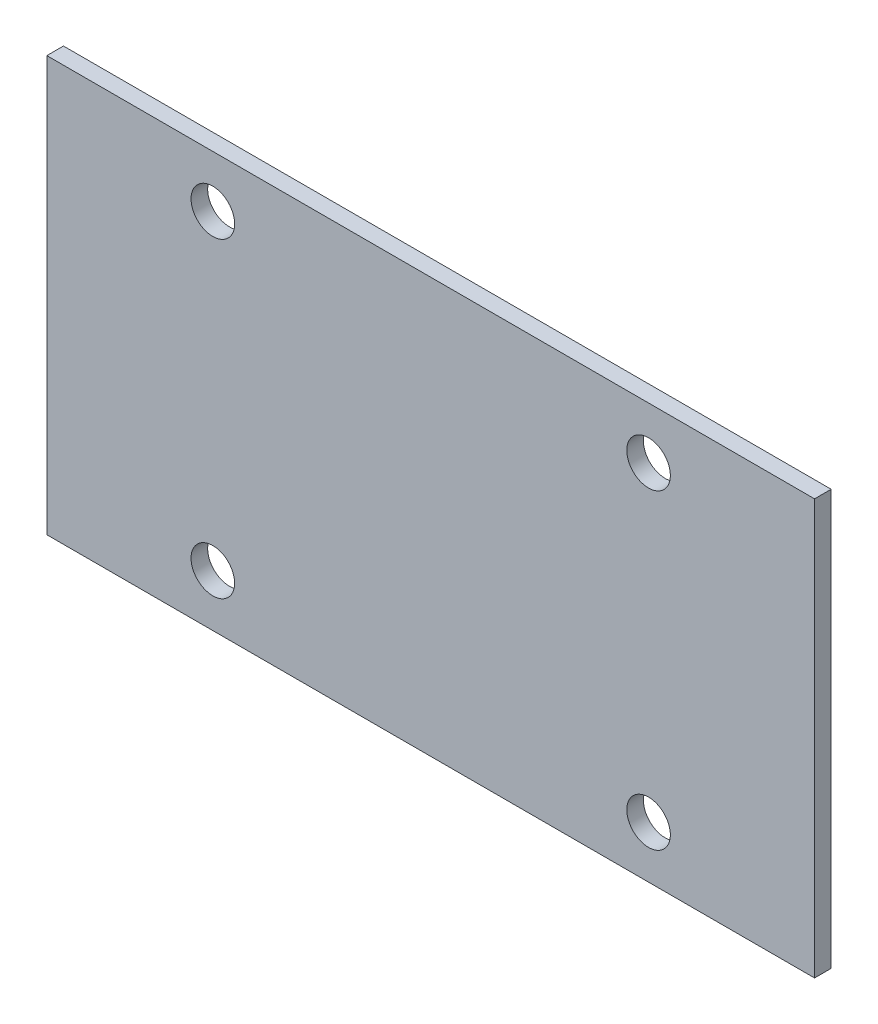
ISO-10303-21;
HEADER;
FILE_DESCRIPTION(('STEP AP214'),'2;1');
FILE_NAME('part.step','',(''),(''),'','','');
FILE_SCHEMA(('AUTOMOTIVE_DESIGN { 1 0 10303 214 1 1 1 1 }'));
ENDSEC;
DATA;
#1=APPLICATION_CONTEXT('core data for automotive mechanical design processes');
#2=APPLICATION_PROTOCOL_DEFINITION('international standard','automotive_design',2000,#1);
#3=PRODUCT_CONTEXT('',#1,'mechanical');
#4=PRODUCT('Part','Part','',(#3));
#5=PRODUCT_RELATED_PRODUCT_CATEGORY('part','',(#4));
#6=PRODUCT_DEFINITION_FORMATION('','',#4);
#7=PRODUCT_DEFINITION_CONTEXT('part definition',#1,'design');
#8=PRODUCT_DEFINITION('design','',#6,#7);
#9=PRODUCT_DEFINITION_SHAPE('','',#8);
#10=(LENGTH_UNIT() NAMED_UNIT(*) SI_UNIT(.MILLI.,.METRE.));
#11=(NAMED_UNIT(*) PLANE_ANGLE_UNIT() SI_UNIT($,.RADIAN.));
#12=(NAMED_UNIT(*) SI_UNIT($,.STERADIAN.) SOLID_ANGLE_UNIT());
#13=UNCERTAINTY_MEASURE_WITH_UNIT(LENGTH_MEASURE(1.E-05),#10,'distance_accuracy_value','');
#14=(GEOMETRIC_REPRESENTATION_CONTEXT(3) GLOBAL_UNCERTAINTY_ASSIGNED_CONTEXT((#13)) GLOBAL_UNIT_ASSIGNED_CONTEXT((#10,
#11,#12)) REPRESENTATION_CONTEXT('',''));
#15=CARTESIAN_POINT('',(0.,0.,0.));
#16=DIRECTION('',(0.,0.,1.));
#17=DIRECTION('',(1.,0.,0.));
#18=AXIS2_PLACEMENT_3D('',#15,#16,#17);
#19=CARTESIAN_POINT('',(0.,0.,3.99999999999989));
#20=DIRECTION('',(0.,0.,1.));
#21=DIRECTION('',(1.,0.,0.));
#22=AXIS2_PLACEMENT_3D('',#19,#20,#21);
#23=PLANE('',#22);
#24=CARTESIAN_POINT('',(145.,12.5,4.));
#25=DIRECTION('',(0.,0.,1.));
#26=DIRECTION('',(1.,0.,0.));
#27=AXIS2_PLACEMENT_3D('',#24,#25,#26);
#28=CIRCLE('',#27,5.25);
#29=CARTESIAN_POINT('',(139.75,12.5,4.));
#30=VERTEX_POINT('',#29);
#31=EDGE_CURVE('E151',#30,#30,#28,.T.);
#32=ORIENTED_EDGE('',*,*,#31,.F.);
#33=EDGE_LOOP('',(#32));
#34=FACE_BOUND('',#33,.T.);
#35=CARTESIAN_POINT('',(40.,87.5000000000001,4.));
#36=DIRECTION('',(0.,0.,1.));
#37=DIRECTION('',(1.,0.,0.));
#38=AXIS2_PLACEMENT_3D('',#35,#36,#37);
#39=CIRCLE('',#38,5.25);
#40=CARTESIAN_POINT('',(34.75,87.5000000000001,4.));
#41=VERTEX_POINT('',#40);
#42=EDGE_CURVE('E100',#41,#41,#39,.T.);
#43=ORIENTED_EDGE('',*,*,#42,.F.);
#44=EDGE_LOOP('',(#43));
#45=FACE_BOUND('',#44,.T.);
#46=DIRECTION('',(0.,-1.,0.));
#47=VECTOR('',#46,1.);
#48=CARTESIAN_POINT('',(0.,100.,4.00000000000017));
#49=LINE('',#48,#47);
#50=CARTESIAN_POINT('',(0.,100.,4.00000000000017));
#51=VERTEX_POINT('',#50);
#52=CARTESIAN_POINT('',(0.,0.,3.99999999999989));
#53=VERTEX_POINT('',#52);
#54=EDGE_CURVE('E114',#51,#53,#49,.T.);
#55=ORIENTED_EDGE('',*,*,#54,.T.);
#56=DIRECTION('',(1.,0.,0.));
#57=VECTOR('',#56,1.);
#58=CARTESIAN_POINT('',(0.,0.,3.99999999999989));
#59=LINE('',#58,#57);
#60=CARTESIAN_POINT('',(185.,0.,4.));
#61=VERTEX_POINT('',#60);
#62=EDGE_CURVE('E94',#53,#61,#59,.T.);
#63=ORIENTED_EDGE('',*,*,#62,.T.);
#64=DIRECTION('',(0.,1.,0.));
#65=VECTOR('',#64,1.);
#66=CARTESIAN_POINT('',(185.,100.,4.00000000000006));
#67=LINE('',#66,#65);
#68=CARTESIAN_POINT('',(185.,100.,4.00000000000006));
#69=VERTEX_POINT('',#68);
#70=EDGE_CURVE('E59',#61,#69,#67,.T.);
#71=ORIENTED_EDGE('',*,*,#70,.T.);
#72=DIRECTION('',(-1.,0.,0.));
#73=VECTOR('',#72,1.);
#74=CARTESIAN_POINT('',(0.,100.,4.00000000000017));
#75=LINE('',#74,#73);
#76=EDGE_CURVE('E54',#69,#51,#75,.T.);
#77=ORIENTED_EDGE('',*,*,#76,.T.);
#78=EDGE_LOOP('',(#55,#63,#71,#77));
#79=FACE_BOUND('',#78,.T.);
#80=CARTESIAN_POINT('',(145.,87.4999999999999,3.99999999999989));
#81=DIRECTION('',(0.,0.,1.));
#82=DIRECTION('',(1.,0.,0.));
#83=AXIS2_PLACEMENT_3D('',#80,#81,#82);
#84=CIRCLE('',#83,5.25);
#85=CARTESIAN_POINT('',(139.75,87.4999999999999,3.99999999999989));
#86=VERTEX_POINT('',#85);
#87=EDGE_CURVE('E139',#86,#86,#84,.T.);
#88=ORIENTED_EDGE('',*,*,#87,.F.);
#89=EDGE_LOOP('',(#88));
#90=FACE_BOUND('',#89,.T.);
#91=CARTESIAN_POINT('',(40.,12.5,4.));
#92=DIRECTION('',(0.,0.,1.));
#93=DIRECTION('',(1.,0.,0.));
#94=AXIS2_PLACEMENT_3D('',#91,#92,#93);
#95=CIRCLE('',#94,5.25);
#96=CARTESIAN_POINT('',(34.75,12.5,4.));
#97=VERTEX_POINT('',#96);
#98=EDGE_CURVE('E142',#97,#97,#95,.T.);
#99=ORIENTED_EDGE('',*,*,#98,.F.);
#100=EDGE_LOOP('',(#99));
#101=FACE_BOUND('',#100,.T.);
#102=ADVANCED_FACE('F38',(#34,#45,#79,#90,#101),#23,.T.);
#103=CARTESIAN_POINT('',(0.,0.,0.));
#104=DIRECTION('',(0.,0.,1.));
#105=DIRECTION('',(1.,0.,0.));
#106=AXIS2_PLACEMENT_3D('',#103,#104,#105);
#107=PLANE('',#106);
#108=CARTESIAN_POINT('',(145.,12.5,0.));
#109=DIRECTION('',(0.,0.,1.));
#110=DIRECTION('',(1.,0.,0.));
#111=AXIS2_PLACEMENT_3D('',#108,#109,#110);
#112=CIRCLE('',#111,5.25);
#113=CARTESIAN_POINT('',(139.75,12.5,0.));
#114=VERTEX_POINT('',#113);
#115=EDGE_CURVE('E145',#114,#114,#112,.T.);
#116=ORIENTED_EDGE('',*,*,#115,.T.);
#117=EDGE_LOOP('',(#116));
#118=FACE_BOUND('',#117,.T.);
#119=CARTESIAN_POINT('',(40.,87.5,0.));
#120=DIRECTION('',(0.,0.,1.));
#121=DIRECTION('',(1.,0.,0.));
#122=AXIS2_PLACEMENT_3D('',#119,#120,#121);
#123=CIRCLE('',#122,5.25);
#124=CARTESIAN_POINT('',(34.75,87.5000000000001,0.));
#125=VERTEX_POINT('',#124);
#126=EDGE_CURVE('E105',#125,#125,#123,.T.);
#127=ORIENTED_EDGE('',*,*,#126,.T.);
#128=EDGE_LOOP('',(#127));
#129=FACE_BOUND('',#128,.T.);
#130=DIRECTION('',(0.,-1.,0.));
#131=VECTOR('',#130,1.);
#132=CARTESIAN_POINT('',(0.,100.,0.));
#133=LINE('',#132,#131);
#134=CARTESIAN_POINT('',(0.,100.,0.));
#135=VERTEX_POINT('',#134);
#136=CARTESIAN_POINT('',(0.,0.,0.));
#137=VERTEX_POINT('',#136);
#138=EDGE_CURVE('E85',#135,#137,#133,.T.);
#139=ORIENTED_EDGE('',*,*,#138,.F.);
#140=DIRECTION('',(-1.,0.,0.));
#141=VECTOR('',#140,1.);
#142=CARTESIAN_POINT('',(0.,100.,0.));
#143=LINE('',#142,#141);
#144=CARTESIAN_POINT('',(185.,100.,0.));
#145=VERTEX_POINT('',#144);
#146=EDGE_CURVE('E111',#145,#135,#143,.T.);
#147=ORIENTED_EDGE('',*,*,#146,.F.);
#148=DIRECTION('',(0.,1.,0.));
#149=VECTOR('',#148,1.);
#150=CARTESIAN_POINT('',(185.,100.,0.));
#151=LINE('',#150,#149);
#152=CARTESIAN_POINT('',(185.,0.,0.));
#153=VERTEX_POINT('',#152);
#154=EDGE_CURVE('E86',#153,#145,#151,.T.);
#155=ORIENTED_EDGE('',*,*,#154,.F.);
#156=DIRECTION('',(1.,0.,0.));
#157=VECTOR('',#156,1.);
#158=CARTESIAN_POINT('',(0.,0.,0.));
#159=LINE('',#158,#157);
#160=EDGE_CURVE('E80',#137,#153,#159,.T.);
#161=ORIENTED_EDGE('',*,*,#160,.F.);
#162=EDGE_LOOP('',(#139,#147,#155,#161));
#163=FACE_BOUND('',#162,.T.);
#164=CARTESIAN_POINT('',(145.,87.4999999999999,0.));
#165=DIRECTION('',(0.,0.,1.));
#166=DIRECTION('',(1.,0.,0.));
#167=AXIS2_PLACEMENT_3D('',#164,#165,#166);
#168=CIRCLE('',#167,5.25);
#169=CARTESIAN_POINT('',(139.75,87.4999999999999,0.));
#170=VERTEX_POINT('',#169);
#171=EDGE_CURVE('E159',#170,#170,#168,.T.);
#172=ORIENTED_EDGE('',*,*,#171,.T.);
#173=EDGE_LOOP('',(#172));
#174=FACE_BOUND('',#173,.T.);
#175=CARTESIAN_POINT('',(40.,12.5,0.));
#176=DIRECTION('',(0.,0.,1.));
#177=DIRECTION('',(1.,0.,0.));
#178=AXIS2_PLACEMENT_3D('',#175,#176,#177);
#179=CIRCLE('',#178,5.25);
#180=CARTESIAN_POINT('',(34.75,12.5,0.));
#181=VERTEX_POINT('',#180);
#182=EDGE_CURVE('E146',#181,#181,#179,.T.);
#183=ORIENTED_EDGE('',*,*,#182,.T.);
#184=EDGE_LOOP('',(#183));
#185=FACE_BOUND('',#184,.T.);
#186=ADVANCED_FACE('F81',(#118,#129,#163,#174,#185),#107,.F.);
#187=CARTESIAN_POINT('',(0.,100.,4.00000000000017));
#188=DIRECTION('',(1.,0.,0.));
#189=DIRECTION('',(0.,1.,0.));
#190=AXIS2_PLACEMENT_3D('',#187,#188,#189);
#191=PLANE('',#190);
#192=ORIENTED_EDGE('',*,*,#138,.T.);
#193=DIRECTION('',(0.,0.,-1.));
#194=VECTOR('',#193,1.);
#195=CARTESIAN_POINT('',(0.,0.,3.99999999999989));
#196=LINE('',#195,#194);
#197=EDGE_CURVE('E11',#53,#137,#196,.T.);
#198=ORIENTED_EDGE('',*,*,#197,.F.);
#199=ORIENTED_EDGE('',*,*,#54,.F.);
#200=DIRECTION('',(0.,0.,-1.));
#201=VECTOR('',#200,1.);
#202=CARTESIAN_POINT('',(0.,100.,4.00000000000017));
#203=LINE('',#202,#201);
#204=EDGE_CURVE('E98',#51,#135,#203,.T.);
#205=ORIENTED_EDGE('',*,*,#204,.T.);
#206=EDGE_LOOP('',(#192,#198,#199,#205));
#207=FACE_BOUND('',#206,.T.);
#208=ADVANCED_FACE('F40',(#207),#191,.F.);
#209=CARTESIAN_POINT('',(0.,0.,3.99999999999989));
#210=DIRECTION('',(0.,1.,0.));
#211=DIRECTION('',(0.,0.,1.));
#212=AXIS2_PLACEMENT_3D('',#209,#210,#211);
#213=PLANE('',#212);
#214=ORIENTED_EDGE('',*,*,#160,.T.);
#215=DIRECTION('',(0.,0.,-1.));
#216=VECTOR('',#215,1.);
#217=CARTESIAN_POINT('',(185.,0.,4.));
#218=LINE('',#217,#216);
#219=EDGE_CURVE('E47',#61,#153,#218,.T.);
#220=ORIENTED_EDGE('',*,*,#219,.F.);
#221=ORIENTED_EDGE('',*,*,#62,.F.);
#222=ORIENTED_EDGE('',*,*,#197,.T.);
#223=EDGE_LOOP('',(#214,#220,#221,#222));
#224=FACE_BOUND('',#223,.T.);
#225=ADVANCED_FACE('F93',(#224),#213,.F.);
#226=CARTESIAN_POINT('',(185.,100.,4.00000000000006));
#227=DIRECTION('',(-1.,0.,0.));
#228=DIRECTION('',(0.,0.,1.));
#229=AXIS2_PLACEMENT_3D('',#226,#227,#228);
#230=PLANE('',#229);
#231=ORIENTED_EDGE('',*,*,#154,.T.);
#232=DIRECTION('',(0.,0.,-1.));
#233=VECTOR('',#232,1.);
#234=CARTESIAN_POINT('',(185.,100.,4.00000000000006));
#235=LINE('',#234,#233);
#236=EDGE_CURVE('E124',#69,#145,#235,.T.);
#237=ORIENTED_EDGE('',*,*,#236,.F.);
#238=ORIENTED_EDGE('',*,*,#70,.F.);
#239=ORIENTED_EDGE('',*,*,#219,.T.);
#240=EDGE_LOOP('',(#231,#237,#238,#239));
#241=FACE_BOUND('',#240,.T.);
#242=ADVANCED_FACE('F129',(#241),#230,.F.);
#243=CARTESIAN_POINT('',(0.,100.,4.00000000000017));
#244=DIRECTION('',(0.,-1.,0.));
#245=DIRECTION('',(0.,0.,-1.));
#246=AXIS2_PLACEMENT_3D('',#243,#244,#245);
#247=PLANE('',#246);
#248=ORIENTED_EDGE('',*,*,#146,.T.);
#249=ORIENTED_EDGE('',*,*,#204,.F.);
#250=ORIENTED_EDGE('',*,*,#76,.F.);
#251=ORIENTED_EDGE('',*,*,#236,.T.);
#252=EDGE_LOOP('',(#248,#249,#250,#251));
#253=FACE_BOUND('',#252,.T.);
#254=ADVANCED_FACE('F131',(#253),#247,.F.);
#255=CARTESIAN_POINT('',(40.,87.5000000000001,4.));
#256=DIRECTION('',(0.,0.,-1.));
#257=DIRECTION('',(-1.,0.,0.));
#258=AXIS2_PLACEMENT_3D('',#255,#256,#257);
#259=CYLINDRICAL_SURFACE('',#258,5.25);
#260=CARTESIAN_POINT('',(34.75,87.5000000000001,4.));
#261=CARTESIAN_POINT('',(34.75,87.5000000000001,3.95833333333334));
#262=CARTESIAN_POINT('',(34.75,87.5000000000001,3.91666666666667));
#263=CARTESIAN_POINT('',(34.75,87.5000000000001,3.83333333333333));
#264=CARTESIAN_POINT('',(34.75,87.5000000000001,3.79166666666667));
#265=CARTESIAN_POINT('',(34.75,87.5000000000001,3.70833333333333));
#266=CARTESIAN_POINT('',(34.75,87.5000000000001,3.66666666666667));
#267=CARTESIAN_POINT('',(34.75,87.5000000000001,3.58333333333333));
#268=CARTESIAN_POINT('',(34.75,87.5000000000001,3.54166666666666));
#269=CARTESIAN_POINT('',(34.75,87.5000000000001,3.45833333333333));
#270=CARTESIAN_POINT('',(34.75,87.5000000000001,3.41666666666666));
#271=CARTESIAN_POINT('',(34.75,87.5000000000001,3.33333333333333));
#272=CARTESIAN_POINT('',(34.75,87.5000000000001,3.29166666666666));
#273=CARTESIAN_POINT('',(34.75,87.5000000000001,3.20833333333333));
#274=CARTESIAN_POINT('',(34.75,87.5000000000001,3.16666666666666));
#275=CARTESIAN_POINT('',(34.75,87.5000000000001,3.08333333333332));
#276=CARTESIAN_POINT('',(34.75,87.5000000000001,3.04166666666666));
#277=CARTESIAN_POINT('',(34.75,87.5000000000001,2.95833333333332));
#278=CARTESIAN_POINT('',(34.75,87.5000000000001,2.91666666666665));
#279=CARTESIAN_POINT('',(34.75,87.5000000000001,2.83333333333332));
#280=CARTESIAN_POINT('',(34.75,87.5000000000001,2.79166666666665));
#281=CARTESIAN_POINT('',(34.75,87.5000000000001,2.70833333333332));
#282=CARTESIAN_POINT('',(34.75,87.5000000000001,2.66666666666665));
#283=CARTESIAN_POINT('',(34.75,87.5000000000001,2.58333333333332));
#284=CARTESIAN_POINT('',(34.75,87.5000000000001,2.54166666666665));
#285=CARTESIAN_POINT('',(34.75,87.5000000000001,2.45833333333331));
#286=CARTESIAN_POINT('',(34.75,87.5000000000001,2.41666666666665));
#287=CARTESIAN_POINT('',(34.75,87.5000000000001,2.33333333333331));
#288=CARTESIAN_POINT('',(34.75,87.5000000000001,2.29166666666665));
#289=CARTESIAN_POINT('',(34.75,87.5000000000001,2.20833333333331));
#290=CARTESIAN_POINT('',(34.75,87.5000000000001,2.16666666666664));
#291=CARTESIAN_POINT('',(34.75,87.5000000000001,2.08333333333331));
#292=CARTESIAN_POINT('',(34.75,87.5000000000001,2.04166666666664));
#293=CARTESIAN_POINT('',(34.75,87.5000000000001,1.95833333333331));
#294=CARTESIAN_POINT('',(34.75,87.5000000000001,1.91666666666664));
#295=CARTESIAN_POINT('',(34.75,87.5000000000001,1.8333333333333));
#296=CARTESIAN_POINT('',(34.75,87.5000000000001,1.79166666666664));
#297=CARTESIAN_POINT('',(34.75,87.5000000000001,1.7083333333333));
#298=CARTESIAN_POINT('',(34.75,87.5000000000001,1.66666666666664));
#299=CARTESIAN_POINT('',(34.75,87.5000000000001,1.5833333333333));
#300=CARTESIAN_POINT('',(34.75,87.5000000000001,1.54166666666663));
#301=CARTESIAN_POINT('',(34.75,87.5000000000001,1.4583333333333));
#302=CARTESIAN_POINT('',(34.75,87.5000000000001,1.41666666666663));
#303=CARTESIAN_POINT('',(34.75,87.5000000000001,1.3333333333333));
#304=CARTESIAN_POINT('',(34.75,87.5000000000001,1.29166666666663));
#305=CARTESIAN_POINT('',(34.75,87.5000000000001,1.2083333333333));
#306=CARTESIAN_POINT('',(34.75,87.5000000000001,1.16666666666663));
#307=CARTESIAN_POINT('',(34.75,87.5000000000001,1.08333333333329));
#308=CARTESIAN_POINT('',(34.75,87.5000000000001,1.04166666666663));
#309=CARTESIAN_POINT('',(34.75,87.5000000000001,0.958333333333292));
#310=CARTESIAN_POINT('',(34.75,87.5000000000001,0.916666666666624));
#311=CARTESIAN_POINT('',(34.75,87.5000000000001,0.83333333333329));
#312=CARTESIAN_POINT('',(34.75,87.5000000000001,0.791666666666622));
#313=CARTESIAN_POINT('',(34.75,87.5000000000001,0.708333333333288));
#314=CARTESIAN_POINT('',(34.75,87.5000000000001,0.666666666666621));
#315=CARTESIAN_POINT('',(34.75,87.5000000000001,0.583333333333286));
#316=CARTESIAN_POINT('',(34.75,87.5000000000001,0.541666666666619));
#317=CARTESIAN_POINT('',(34.75,87.5000000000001,0.458333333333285));
#318=CARTESIAN_POINT('',(34.75,87.5000000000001,0.416666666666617));
#319=CARTESIAN_POINT('',(34.75,87.5000000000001,0.333333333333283));
#320=CARTESIAN_POINT('',(34.75,87.5000000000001,0.291666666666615));
#321=CARTESIAN_POINT('',(34.75,87.5000000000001,0.20833333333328));
#322=CARTESIAN_POINT('',(34.75,87.5000000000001,0.166666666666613));
#323=CARTESIAN_POINT('',(34.75,87.5000000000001,0.0833333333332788));
#324=CARTESIAN_POINT('',(34.75,87.5000000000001,0.0416666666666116));
#325=CARTESIAN_POINT('',(34.75,87.5000000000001,0.));
#326=B_SPLINE_CURVE_WITH_KNOTS('',3,(#260,#261,#262,#263,#264,#265,#266,#267,#268,#269,#270,
#271,#272,#273,#274,#275,#276,#277,#278,#279,#280,#281,#282,#283,#284,#285,#286,#287,#288,#289,
#290,#291,#292,#293,#294,#295,#296,#297,#298,#299,#300,#301,#302,#303,#304,#305,#306,#307,#308,
#309,#310,#311,#312,#313,#314,#315,#316,#317,#318,#319,#320,#321,#322,#323,#324,#325),
.UNSPECIFIED.,.F.,.F.,(4,2,2,2,2,2,2,2,2,2,2,2,2,2,2,2,2,2,2,2,2,2,2,2,2,2,2,2,2,2,2,2,4),(0.,
0.125000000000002,0.250000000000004,0.375000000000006,0.500000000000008,0.62500000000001,
0.750000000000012,0.875000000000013,1.00000000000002,1.12500000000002,1.25000000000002,
1.37500000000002,1.50000000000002,1.62500000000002,1.75000000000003,1.87500000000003,
2.00000000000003,2.12500000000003,2.25000000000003,2.37500000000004,2.50000000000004,
2.62500000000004,2.75000000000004,2.87500000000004,3.00000000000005,3.12500000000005,
3.25000000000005,3.37500000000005,3.50000000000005,3.62500000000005,3.75000000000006,
3.87500000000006,4.00000000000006),.UNSPECIFIED.);
#327=EDGE_CURVE('BSEAM169',#41,#125,#326,.T.);
#328=ORIENTED_EDGE('',*,*,#42,.T.);
#329=ORIENTED_EDGE('',*,*,#126,.F.);
#330=ORIENTED_EDGE('',*,*,#327,.T.);
#331=ORIENTED_EDGE('',*,*,#327,.F.);
#332=EDGE_LOOP('',(#328,#330,#329,#331));
#333=FACE_BOUND('',#332,.T.);
#334=ADVANCED_FACE('F169',(#333),#259,.F.);
#335=CARTESIAN_POINT('',(145.,87.4999999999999,3.99999999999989));
#336=DIRECTION('',(0.,0.,-1.));
#337=DIRECTION('',(-1.,0.,0.));
#338=AXIS2_PLACEMENT_3D('',#335,#336,#337);
#339=CYLINDRICAL_SURFACE('',#338,5.25);
#340=CARTESIAN_POINT('',(139.75,87.4999999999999,3.99999999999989));
#341=CARTESIAN_POINT('',(139.75,87.4999999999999,3.95833333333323));
#342=CARTESIAN_POINT('',(139.75,87.4999999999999,3.91666666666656));
#343=CARTESIAN_POINT('',(139.75,87.4999999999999,3.83333333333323));
#344=CARTESIAN_POINT('',(139.75,87.4999999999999,3.79166666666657));
#345=CARTESIAN_POINT('',(139.75,87.4999999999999,3.70833333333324));
#346=CARTESIAN_POINT('',(139.75,87.4999999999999,3.66666666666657));
#347=CARTESIAN_POINT('',(139.75,87.4999999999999,3.58333333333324));
#348=CARTESIAN_POINT('',(139.75,87.4999999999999,3.54166666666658));
#349=CARTESIAN_POINT('',(139.75,87.4999999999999,3.45833333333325));
#350=CARTESIAN_POINT('',(139.75,87.4999999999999,3.41666666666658));
#351=CARTESIAN_POINT('',(139.75,87.4999999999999,3.33333333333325));
#352=CARTESIAN_POINT('',(139.75,87.4999999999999,3.29166666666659));
#353=CARTESIAN_POINT('',(139.75,87.4999999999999,3.20833333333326));
#354=CARTESIAN_POINT('',(139.75,87.4999999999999,3.16666666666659));
#355=CARTESIAN_POINT('',(139.75,87.4999999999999,3.08333333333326));
#356=CARTESIAN_POINT('',(139.75,87.4999999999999,3.0416666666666));
#357=CARTESIAN_POINT('',(139.75,87.4999999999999,2.95833333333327));
#358=CARTESIAN_POINT('',(139.75,87.4999999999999,2.9166666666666));
#359=CARTESIAN_POINT('',(139.75,87.4999999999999,2.83333333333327));
#360=CARTESIAN_POINT('',(139.75,87.4999999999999,2.79166666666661));
#361=CARTESIAN_POINT('',(139.75,87.4999999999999,2.70833333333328));
#362=CARTESIAN_POINT('',(139.75,87.4999999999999,2.66666666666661));
#363=CARTESIAN_POINT('',(139.75,87.4999999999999,2.58333333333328));
#364=CARTESIAN_POINT('',(139.75,87.4999999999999,2.54166666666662));
#365=CARTESIAN_POINT('',(139.75,87.4999999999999,2.45833333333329));
#366=CARTESIAN_POINT('',(139.75,87.4999999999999,2.41666666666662));
#367=CARTESIAN_POINT('',(139.75,87.4999999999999,2.33333333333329));
#368=CARTESIAN_POINT('',(139.75,87.4999999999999,2.29166666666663));
#369=CARTESIAN_POINT('',(139.75,87.4999999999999,2.2083333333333));
#370=CARTESIAN_POINT('',(139.75,87.4999999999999,2.16666666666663));
#371=CARTESIAN_POINT('',(139.75,87.4999999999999,2.0833333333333));
#372=CARTESIAN_POINT('',(139.75,87.4999999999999,2.04166666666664));
#373=CARTESIAN_POINT('',(139.75,87.4999999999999,1.95833333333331));
#374=CARTESIAN_POINT('',(139.75,87.4999999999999,1.91666666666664));
#375=CARTESIAN_POINT('',(139.75,87.4999999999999,1.83333333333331));
#376=CARTESIAN_POINT('',(139.75,87.4999999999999,1.79166666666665));
#377=CARTESIAN_POINT('',(139.75,87.4999999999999,1.70833333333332));
#378=CARTESIAN_POINT('',(139.75,87.4999999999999,1.66666666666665));
#379=CARTESIAN_POINT('',(139.75,87.4999999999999,1.58333333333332));
#380=CARTESIAN_POINT('',(139.75,87.4999999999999,1.54166666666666));
#381=CARTESIAN_POINT('',(139.75,87.4999999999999,1.45833333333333));
#382=CARTESIAN_POINT('',(139.75,87.4999999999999,1.41666666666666));
#383=CARTESIAN_POINT('',(139.75,87.4999999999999,1.33333333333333));
#384=CARTESIAN_POINT('',(139.75,87.4999999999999,1.29166666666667));
#385=CARTESIAN_POINT('',(139.75,87.4999999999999,1.20833333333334));
#386=CARTESIAN_POINT('',(139.75,87.4999999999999,1.16666666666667));
#387=CARTESIAN_POINT('',(139.75,87.4999999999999,1.08333333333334));
#388=CARTESIAN_POINT('',(139.75,87.4999999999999,1.04166666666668));
#389=CARTESIAN_POINT('',(139.75,87.4999999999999,0.95833333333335));
#390=CARTESIAN_POINT('',(139.75,87.4999999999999,0.916666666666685));
#391=CARTESIAN_POINT('',(139.75,87.4999999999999,0.833333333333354));
#392=CARTESIAN_POINT('',(139.75,87.4999999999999,0.79166666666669));
#393=CARTESIAN_POINT('',(139.75,87.4999999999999,0.708333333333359));
#394=CARTESIAN_POINT('',(139.75,87.4999999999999,0.666666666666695));
#395=CARTESIAN_POINT('',(139.75,87.4999999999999,0.583333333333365));
#396=CARTESIAN_POINT('',(139.75,87.4999999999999,0.5416666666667));
#397=CARTESIAN_POINT('',(139.75,87.4999999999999,0.45833333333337));
#398=CARTESIAN_POINT('',(139.75,87.4999999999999,0.416666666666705));
#399=CARTESIAN_POINT('',(139.75,87.4999999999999,0.333333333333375));
#400=CARTESIAN_POINT('',(139.75,87.4999999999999,0.29166666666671));
#401=CARTESIAN_POINT('',(139.75,87.4999999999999,0.20833333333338));
#402=CARTESIAN_POINT('',(139.75,87.4999999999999,0.166666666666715));
#403=CARTESIAN_POINT('',(139.75,87.4999999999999,0.0833333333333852));
#404=CARTESIAN_POINT('',(139.75,87.4999999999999,0.0416666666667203));
#405=CARTESIAN_POINT('',(139.75,87.4999999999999,0.));
#406=B_SPLINE_CURVE_WITH_KNOTS('',3,(#340,#341,#342,#343,#344,#345,#346,#347,#348,#349,#350,
#351,#352,#353,#354,#355,#356,#357,#358,#359,#360,#361,#362,#363,#364,#365,#366,#367,#368,#369,
#370,#371,#372,#373,#374,#375,#376,#377,#378,#379,#380,#381,#382,#383,#384,#385,#386,#387,#388,
#389,#390,#391,#392,#393,#394,#395,#396,#397,#398,#399,#400,#401,#402,#403,#404,#405),
.UNSPECIFIED.,.F.,.F.,(4,2,2,2,2,2,2,2,2,2,2,2,2,2,2,2,2,2,2,2,2,2,2,2,2,2,2,2,2,2,2,2,4),(0.,
0.124999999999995,0.24999999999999,0.374999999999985,0.49999999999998,0.624999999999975,
0.74999999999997,0.874999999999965,0.99999999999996,1.12499999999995,1.24999999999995,
1.37499999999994,1.49999999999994,1.62499999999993,1.74999999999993,1.87499999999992,
1.99999999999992,2.12499999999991,2.24999999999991,2.3749999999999,2.4999999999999,
2.62499999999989,2.74999999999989,2.87499999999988,2.99999999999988,3.12499999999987,
3.24999999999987,3.37499999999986,3.49999999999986,3.62499999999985,3.74999999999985,
3.87499999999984,3.99999999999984),.UNSPECIFIED.);
#407=EDGE_CURVE('BSEAM171',#86,#170,#406,.T.);
#408=ORIENTED_EDGE('',*,*,#87,.T.);
#409=ORIENTED_EDGE('',*,*,#171,.F.);
#410=ORIENTED_EDGE('',*,*,#407,.T.);
#411=ORIENTED_EDGE('',*,*,#407,.F.);
#412=EDGE_LOOP('',(#408,#410,#409,#411));
#413=FACE_BOUND('',#412,.T.);
#414=ADVANCED_FACE('F171',(#413),#339,.F.);
#415=CARTESIAN_POINT('',(145.,12.5,4.));
#416=DIRECTION('',(0.,0.,-1.));
#417=DIRECTION('',(-1.,0.,0.));
#418=AXIS2_PLACEMENT_3D('',#415,#416,#417);
#419=CYLINDRICAL_SURFACE('',#418,5.25);
#420=CARTESIAN_POINT('',(139.75,12.5,4.));
#421=CARTESIAN_POINT('',(139.75,12.5,3.95833333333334));
#422=CARTESIAN_POINT('',(139.75,12.5,3.91666666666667));
#423=CARTESIAN_POINT('',(139.75,12.5,3.83333333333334));
#424=CARTESIAN_POINT('',(139.75,12.5,3.79166666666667));
#425=CARTESIAN_POINT('',(139.75,12.5,3.70833333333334));
#426=CARTESIAN_POINT('',(139.75,12.5,3.66666666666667));
#427=CARTESIAN_POINT('',(139.75,12.5,3.58333333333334));
#428=CARTESIAN_POINT('',(139.75,12.5,3.54166666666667));
#429=CARTESIAN_POINT('',(139.75,12.5,3.45833333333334));
#430=CARTESIAN_POINT('',(139.75,12.5,3.41666666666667));
#431=CARTESIAN_POINT('',(139.75,12.5,3.33333333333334));
#432=CARTESIAN_POINT('',(139.75,12.5,3.29166666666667));
#433=CARTESIAN_POINT('',(139.75,12.5,3.20833333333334));
#434=CARTESIAN_POINT('',(139.75,12.5,3.16666666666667));
#435=CARTESIAN_POINT('',(139.75,12.5,3.08333333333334));
#436=CARTESIAN_POINT('',(139.75,12.5,3.04166666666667));
#437=CARTESIAN_POINT('',(139.75,12.5,2.95833333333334));
#438=CARTESIAN_POINT('',(139.75,12.5,2.91666666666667));
#439=CARTESIAN_POINT('',(139.75,12.5,2.83333333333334));
#440=CARTESIAN_POINT('',(139.75,12.5,2.79166666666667));
#441=CARTESIAN_POINT('',(139.75,12.5,2.70833333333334));
#442=CARTESIAN_POINT('',(139.75,12.5,2.66666666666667));
#443=CARTESIAN_POINT('',(139.75,12.5,2.58333333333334));
#444=CARTESIAN_POINT('',(139.75,12.5,2.54166666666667));
#445=CARTESIAN_POINT('',(139.75,12.5,2.45833333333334));
#446=CARTESIAN_POINT('',(139.75,12.5,2.41666666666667));
#447=CARTESIAN_POINT('',(139.75,12.5,2.33333333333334));
#448=CARTESIAN_POINT('',(139.75,12.5,2.29166666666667));
#449=CARTESIAN_POINT('',(139.75,12.5,2.20833333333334));
#450=CARTESIAN_POINT('',(139.75,12.5,2.16666666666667));
#451=CARTESIAN_POINT('',(139.75,12.5,2.08333333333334));
#452=CARTESIAN_POINT('',(139.75,12.5,2.04166666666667));
#453=CARTESIAN_POINT('',(139.75,12.5,1.95833333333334));
#454=CARTESIAN_POINT('',(139.75,12.5,1.91666666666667));
#455=CARTESIAN_POINT('',(139.75,12.5,1.83333333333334));
#456=CARTESIAN_POINT('',(139.75,12.5,1.79166666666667));
#457=CARTESIAN_POINT('',(139.75,12.5,1.70833333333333));
#458=CARTESIAN_POINT('',(139.75,12.5,1.66666666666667));
#459=CARTESIAN_POINT('',(139.75,12.5,1.58333333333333));
#460=CARTESIAN_POINT('',(139.75,12.5,1.54166666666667));
#461=CARTESIAN_POINT('',(139.75,12.5,1.45833333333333));
#462=CARTESIAN_POINT('',(139.75,12.5,1.41666666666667));
#463=CARTESIAN_POINT('',(139.75,12.5,1.33333333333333));
#464=CARTESIAN_POINT('',(139.75,12.5,1.29166666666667));
#465=CARTESIAN_POINT('',(139.75,12.5,1.20833333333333));
#466=CARTESIAN_POINT('',(139.75,12.5,1.16666666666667));
#467=CARTESIAN_POINT('',(139.75,12.5,1.08333333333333));
#468=CARTESIAN_POINT('',(139.75,12.5,1.04166666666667));
#469=CARTESIAN_POINT('',(139.75,12.5,0.958333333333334));
#470=CARTESIAN_POINT('',(139.75,12.5,0.916666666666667));
#471=CARTESIAN_POINT('',(139.75,12.5,0.833333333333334));
#472=CARTESIAN_POINT('',(139.75,12.5,0.791666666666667));
#473=CARTESIAN_POINT('',(139.75,12.5,0.708333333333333));
#474=CARTESIAN_POINT('',(139.75,12.5,0.666666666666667));
#475=CARTESIAN_POINT('',(139.75,12.5,0.583333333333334));
#476=CARTESIAN_POINT('',(139.75,12.5,0.541666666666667));
#477=CARTESIAN_POINT('',(139.75,12.5,0.458333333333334));
#478=CARTESIAN_POINT('',(139.75,12.5,0.416666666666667));
#479=CARTESIAN_POINT('',(139.75,12.5,0.333333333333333));
#480=CARTESIAN_POINT('',(139.75,12.5,0.291666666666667));
#481=CARTESIAN_POINT('',(139.75,12.5,0.208333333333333));
#482=CARTESIAN_POINT('',(139.75,12.5,0.166666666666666));
#483=CARTESIAN_POINT('',(139.75,12.5,0.0833333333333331));
#484=CARTESIAN_POINT('',(139.75,12.5,0.0416666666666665));
#485=CARTESIAN_POINT('',(139.75,12.5,0.));
#486=B_SPLINE_CURVE_WITH_KNOTS('',3,(#420,#421,#422,#423,#424,#425,#426,#427,#428,#429,#430,
#431,#432,#433,#434,#435,#436,#437,#438,#439,#440,#441,#442,#443,#444,#445,#446,#447,#448,#449,
#450,#451,#452,#453,#454,#455,#456,#457,#458,#459,#460,#461,#462,#463,#464,#465,#466,#467,#468,
#469,#470,#471,#472,#473,#474,#475,#476,#477,#478,#479,#480,#481,#482,#483,#484,#485),
.UNSPECIFIED.,.F.,.F.,(4,2,2,2,2,2,2,2,2,2,2,2,2,2,2,2,2,2,2,2,2,2,2,2,2,2,2,2,2,2,2,2,4),(0.,
0.125000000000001,0.250000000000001,0.375000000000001,0.500000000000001,0.625000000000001,
0.750000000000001,0.875000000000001,1.,1.125,1.25,1.375,1.5,1.625,1.75,1.875,2.,2.125,2.25,
2.375,2.5,2.625,2.75,2.875,3.,3.125,3.25,3.375,3.5,3.625,3.75,3.875,4.),.UNSPECIFIED.);
#487=EDGE_CURVE('BSEAM178',#30,#114,#486,.T.);
#488=ORIENTED_EDGE('',*,*,#31,.T.);
#489=ORIENTED_EDGE('',*,*,#115,.F.);
#490=ORIENTED_EDGE('',*,*,#487,.T.);
#491=ORIENTED_EDGE('',*,*,#487,.F.);
#492=EDGE_LOOP('',(#488,#490,#489,#491));
#493=FACE_BOUND('',#492,.T.);
#494=ADVANCED_FACE('F178',(#493),#419,.F.);
#495=CARTESIAN_POINT('',(40.,12.5,4.));
#496=DIRECTION('',(0.,0.,-1.));
#497=DIRECTION('',(-1.,0.,0.));
#498=AXIS2_PLACEMENT_3D('',#495,#496,#497);
#499=CYLINDRICAL_SURFACE('',#498,5.25);
#500=CARTESIAN_POINT('',(34.75,12.5,4.));
#501=CARTESIAN_POINT('',(34.75,12.5,3.95833333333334));
#502=CARTESIAN_POINT('',(34.75,12.5,3.91666666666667));
#503=CARTESIAN_POINT('',(34.75,12.5,3.83333333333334));
#504=CARTESIAN_POINT('',(34.75,12.5,3.79166666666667));
#505=CARTESIAN_POINT('',(34.75,12.5,3.70833333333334));
#506=CARTESIAN_POINT('',(34.75,12.5,3.66666666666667));
#507=CARTESIAN_POINT('',(34.75,12.5,3.58333333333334));
#508=CARTESIAN_POINT('',(34.75,12.5,3.54166666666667));
#509=CARTESIAN_POINT('',(34.75,12.5,3.45833333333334));
#510=CARTESIAN_POINT('',(34.75,12.5,3.41666666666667));
#511=CARTESIAN_POINT('',(34.75,12.5,3.33333333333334));
#512=CARTESIAN_POINT('',(34.75,12.5,3.29166666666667));
#513=CARTESIAN_POINT('',(34.75,12.5,3.20833333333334));
#514=CARTESIAN_POINT('',(34.75,12.5,3.16666666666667));
#515=CARTESIAN_POINT('',(34.75,12.5,3.08333333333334));
#516=CARTESIAN_POINT('',(34.75,12.5,3.04166666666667));
#517=CARTESIAN_POINT('',(34.75,12.5,2.95833333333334));
#518=CARTESIAN_POINT('',(34.75,12.5,2.91666666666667));
#519=CARTESIAN_POINT('',(34.75,12.5,2.83333333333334));
#520=CARTESIAN_POINT('',(34.75,12.5,2.79166666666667));
#521=CARTESIAN_POINT('',(34.75,12.5,2.70833333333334));
#522=CARTESIAN_POINT('',(34.75,12.5,2.66666666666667));
#523=CARTESIAN_POINT('',(34.75,12.5,2.58333333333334));
#524=CARTESIAN_POINT('',(34.75,12.5,2.54166666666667));
#525=CARTESIAN_POINT('',(34.75,12.5,2.45833333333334));
#526=CARTESIAN_POINT('',(34.75,12.5,2.41666666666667));
#527=CARTESIAN_POINT('',(34.75,12.5,2.33333333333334));
#528=CARTESIAN_POINT('',(34.75,12.5,2.29166666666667));
#529=CARTESIAN_POINT('',(34.75,12.5,2.20833333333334));
#530=CARTESIAN_POINT('',(34.75,12.5,2.16666666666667));
#531=CARTESIAN_POINT('',(34.75,12.5,2.08333333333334));
#532=CARTESIAN_POINT('',(34.75,12.5,2.04166666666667));
#533=CARTESIAN_POINT('',(34.75,12.5,1.95833333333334));
#534=CARTESIAN_POINT('',(34.75,12.5,1.91666666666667));
#535=CARTESIAN_POINT('',(34.75,12.5,1.83333333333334));
#536=CARTESIAN_POINT('',(34.75,12.5,1.79166666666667));
#537=CARTESIAN_POINT('',(34.75,12.5,1.70833333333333));
#538=CARTESIAN_POINT('',(34.75,12.5,1.66666666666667));
#539=CARTESIAN_POINT('',(34.75,12.5,1.58333333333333));
#540=CARTESIAN_POINT('',(34.75,12.5,1.54166666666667));
#541=CARTESIAN_POINT('',(34.75,12.5,1.45833333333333));
#542=CARTESIAN_POINT('',(34.75,12.5,1.41666666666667));
#543=CARTESIAN_POINT('',(34.75,12.5,1.33333333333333));
#544=CARTESIAN_POINT('',(34.75,12.5,1.29166666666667));
#545=CARTESIAN_POINT('',(34.75,12.5,1.20833333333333));
#546=CARTESIAN_POINT('',(34.75,12.5,1.16666666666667));
#547=CARTESIAN_POINT('',(34.75,12.5,1.08333333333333));
#548=CARTESIAN_POINT('',(34.75,12.5,1.04166666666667));
#549=CARTESIAN_POINT('',(34.75,12.5,0.958333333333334));
#550=CARTESIAN_POINT('',(34.75,12.5,0.916666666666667));
#551=CARTESIAN_POINT('',(34.75,12.5,0.833333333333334));
#552=CARTESIAN_POINT('',(34.75,12.5,0.791666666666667));
#553=CARTESIAN_POINT('',(34.75,12.5,0.708333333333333));
#554=CARTESIAN_POINT('',(34.75,12.5,0.666666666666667));
#555=CARTESIAN_POINT('',(34.75,12.5,0.583333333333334));
#556=CARTESIAN_POINT('',(34.75,12.5,0.541666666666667));
#557=CARTESIAN_POINT('',(34.75,12.5,0.458333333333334));
#558=CARTESIAN_POINT('',(34.75,12.5,0.416666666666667));
#559=CARTESIAN_POINT('',(34.75,12.5,0.333333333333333));
#560=CARTESIAN_POINT('',(34.75,12.5,0.291666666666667));
#561=CARTESIAN_POINT('',(34.75,12.5,0.208333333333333));
#562=CARTESIAN_POINT('',(34.75,12.5,0.166666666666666));
#563=CARTESIAN_POINT('',(34.75,12.5,0.0833333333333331));
#564=CARTESIAN_POINT('',(34.75,12.5,0.0416666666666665));
#565=CARTESIAN_POINT('',(34.75,12.5,0.));
#566=B_SPLINE_CURVE_WITH_KNOTS('',3,(#500,#501,#502,#503,#504,#505,#506,#507,#508,#509,#510,
#511,#512,#513,#514,#515,#516,#517,#518,#519,#520,#521,#522,#523,#524,#525,#526,#527,#528,#529,
#530,#531,#532,#533,#534,#535,#536,#537,#538,#539,#540,#541,#542,#543,#544,#545,#546,#547,#548,
#549,#550,#551,#552,#553,#554,#555,#556,#557,#558,#559,#560,#561,#562,#563,#564,#565),
.UNSPECIFIED.,.F.,.F.,(4,2,2,2,2,2,2,2,2,2,2,2,2,2,2,2,2,2,2,2,2,2,2,2,2,2,2,2,2,2,2,2,4),(0.,
0.125000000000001,0.250000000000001,0.375000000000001,0.500000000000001,0.625000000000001,
0.750000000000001,0.875000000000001,1.,1.125,1.25,1.375,1.5,1.625,1.75,1.875,2.,2.125,2.25,
2.375,2.5,2.625,2.75,2.875,3.,3.125,3.25,3.375,3.5,3.625,3.75,3.875,4.),.UNSPECIFIED.);
#567=EDGE_CURVE('BSEAM255',#97,#181,#566,.T.);
#568=ORIENTED_EDGE('',*,*,#98,.T.);
#569=ORIENTED_EDGE('',*,*,#182,.F.);
#570=ORIENTED_EDGE('',*,*,#567,.T.);
#571=ORIENTED_EDGE('',*,*,#567,.F.);
#572=EDGE_LOOP('',(#568,#570,#569,#571));
#573=FACE_BOUND('',#572,.T.);
#574=ADVANCED_FACE('F255',(#573),#499,.F.);
#575=CLOSED_SHELL('',(#102,#186,#208,#225,#242,#254,#334,#414,#494,#574));
#576=MANIFOLD_SOLID_BREP('B2',#575);
#577=ADVANCED_BREP_SHAPE_REPRESENTATION('',(#18,#576),#14);
#578=SHAPE_DEFINITION_REPRESENTATION(#9,#577);
ENDSEC;
END-ISO-10303-21;
